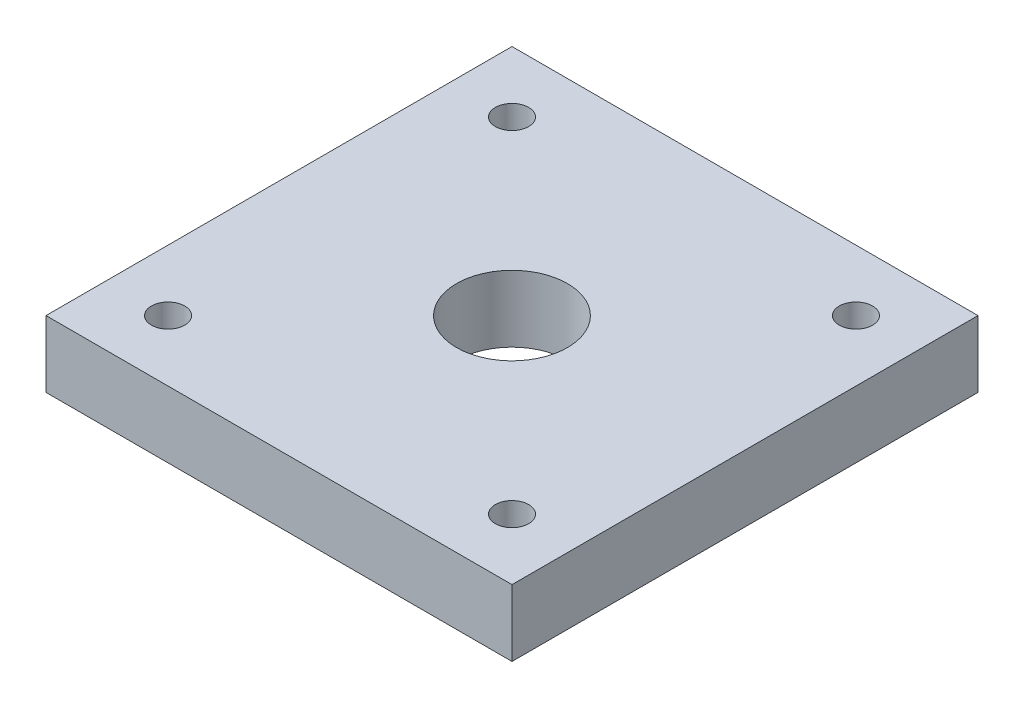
ISO-10303-21;
HEADER;
FILE_DESCRIPTION(('STEP AP214'),'2;1');
FILE_NAME('part.step','',(''),(''),'','','');
FILE_SCHEMA(('AUTOMOTIVE_DESIGN { 1 0 10303 214 1 1 1 1 }'));
ENDSEC;
DATA;
#1=APPLICATION_CONTEXT('core data for automotive mechanical design processes');
#2=APPLICATION_PROTOCOL_DEFINITION('international standard','automotive_design',2000,#1);
#3=PRODUCT_CONTEXT('',#1,'mechanical');
#4=PRODUCT('Part','Part','',(#3));
#5=PRODUCT_RELATED_PRODUCT_CATEGORY('part','',(#4));
#6=PRODUCT_DEFINITION_FORMATION('','',#4);
#7=PRODUCT_DEFINITION_CONTEXT('part definition',#1,'design');
#8=PRODUCT_DEFINITION('design','',#6,#7);
#9=PRODUCT_DEFINITION_SHAPE('','',#8);
#10=(LENGTH_UNIT() NAMED_UNIT(*) SI_UNIT(.MILLI.,.METRE.));
#11=(NAMED_UNIT(*) PLANE_ANGLE_UNIT() SI_UNIT($,.RADIAN.));
#12=(NAMED_UNIT(*) SI_UNIT($,.STERADIAN.) SOLID_ANGLE_UNIT());
#13=UNCERTAINTY_MEASURE_WITH_UNIT(LENGTH_MEASURE(1.E-05),#10,'distance_accuracy_value','');
#14=(GEOMETRIC_REPRESENTATION_CONTEXT(3) GLOBAL_UNCERTAINTY_ASSIGNED_CONTEXT((#13)) GLOBAL_UNIT_ASSIGNED_CONTEXT((#10,
#11,#12)) REPRESENTATION_CONTEXT('',''));
#15=CARTESIAN_POINT('',(0.,0.,0.));
#16=DIRECTION('',(0.,0.,1.));
#17=DIRECTION('',(1.,0.,0.));
#18=AXIS2_PLACEMENT_3D('',#15,#16,#17);
#19=CARTESIAN_POINT('',(0.,6.,0.));
#20=DIRECTION('',(0.,-1.,0.));
#21=DIRECTION('',(0.,0.,-1.));
#22=AXIS2_PLACEMENT_3D('',#19,#20,#21);
#23=PLANE('',#22);
#24=CARTESIAN_POINT('',(5.5,6.,-5.50000000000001));
#25=DIRECTION('',(0.,1.,0.));
#26=DIRECTION('',(0.,0.,1.));
#27=AXIS2_PLACEMENT_3D('',#24,#25,#26);
#28=CIRCLE('',#27,1.5);
#29=CARTESIAN_POINT('',(5.5,6.,-4.));
#30=VERTEX_POINT('',#29);
#31=EDGE_CURVE('E129',#30,#30,#28,.T.);
#32=ORIENTED_EDGE('',*,*,#31,.F.);
#33=EDGE_LOOP('',(#32));
#34=FACE_BOUND('',#33,.T.);
#35=CARTESIAN_POINT('',(36.5,6.,-36.5));
#36=DIRECTION('',(0.,1.,0.));
#37=DIRECTION('',(0.,0.,1.));
#38=AXIS2_PLACEMENT_3D('',#35,#36,#37);
#39=CIRCLE('',#38,1.5);
#40=CARTESIAN_POINT('',(36.5,6.,-35.));
#41=VERTEX_POINT('',#40);
#42=EDGE_CURVE('E117',#41,#41,#39,.T.);
#43=ORIENTED_EDGE('',*,*,#42,.F.);
#44=EDGE_LOOP('',(#43));
#45=FACE_BOUND('',#44,.T.);
#46=DIRECTION('',(0.,0.,1.));
#47=VECTOR('',#46,1.);
#48=CARTESIAN_POINT('',(0.,6.,0.));
#49=LINE('',#48,#47);
#50=CARTESIAN_POINT('',(0.,6.,-42.));
#51=VERTEX_POINT('',#50);
#52=CARTESIAN_POINT('',(0.,6.,0.));
#53=VERTEX_POINT('',#52);
#54=EDGE_CURVE('E87',#51,#53,#49,.T.);
#55=ORIENTED_EDGE('',*,*,#54,.T.);
#56=DIRECTION('',(1.,0.,0.));
#57=VECTOR('',#56,1.);
#58=CARTESIAN_POINT('',(0.,6.,0.));
#59=LINE('',#58,#57);
#60=CARTESIAN_POINT('',(42.,6.,0.));
#61=VERTEX_POINT('',#60);
#62=EDGE_CURVE('E82',#53,#61,#59,.T.);
#63=ORIENTED_EDGE('',*,*,#62,.T.);
#64=DIRECTION('',(0.,0.,-1.));
#65=VECTOR('',#64,1.);
#66=CARTESIAN_POINT('',(42.,6.,0.));
#67=LINE('',#66,#65);
#68=CARTESIAN_POINT('',(42.,6.,-42.));
#69=VERTEX_POINT('',#68);
#70=EDGE_CURVE('E85',#61,#69,#67,.T.);
#71=ORIENTED_EDGE('',*,*,#70,.T.);
#72=DIRECTION('',(-1.,0.,0.));
#73=VECTOR('',#72,1.);
#74=CARTESIAN_POINT('',(0.,6.,-42.));
#75=LINE('',#74,#73);
#76=EDGE_CURVE('E52',#69,#51,#75,.T.);
#77=ORIENTED_EDGE('',*,*,#76,.T.);
#78=EDGE_LOOP('',(#55,#63,#71,#77));
#79=FACE_BOUND('',#78,.T.);
#80=CARTESIAN_POINT('',(5.5,6.,-36.5));
#81=DIRECTION('',(0.,1.,0.));
#82=DIRECTION('',(0.,0.,1.));
#83=AXIS2_PLACEMENT_3D('',#80,#81,#82);
#84=CIRCLE('',#83,1.5);
#85=CARTESIAN_POINT('',(5.5,6.,-35.));
#86=VERTEX_POINT('',#85);
#87=EDGE_CURVE('E102',#86,#86,#84,.T.);
#88=ORIENTED_EDGE('',*,*,#87,.F.);
#89=EDGE_LOOP('',(#88));
#90=FACE_BOUND('',#89,.T.);
#91=CARTESIAN_POINT('',(36.5,6.,-5.50000000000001));
#92=DIRECTION('',(0.,1.,0.));
#93=DIRECTION('',(0.,0.,1.));
#94=AXIS2_PLACEMENT_3D('',#91,#92,#93);
#95=CIRCLE('',#94,1.5);
#96=CARTESIAN_POINT('',(36.5,6.,-4.));
#97=VERTEX_POINT('',#96);
#98=EDGE_CURVE('E123',#97,#97,#95,.T.);
#99=ORIENTED_EDGE('',*,*,#98,.F.);
#100=EDGE_LOOP('',(#99));
#101=FACE_BOUND('',#100,.T.);
#102=CARTESIAN_POINT('',(21.,6.,-21.));
#103=DIRECTION('',(0.,1.,0.));
#104=DIRECTION('',(0.,0.,1.));
#105=AXIS2_PLACEMENT_3D('',#102,#103,#104);
#106=CIRCLE('',#105,5.);
#107=CARTESIAN_POINT('',(21.,6.,-16.));
#108=VERTEX_POINT('',#107);
#109=EDGE_CURVE('E135',#108,#108,#106,.T.);
#110=ORIENTED_EDGE('',*,*,#109,.F.);
#111=EDGE_LOOP('',(#110));
#112=FACE_BOUND('',#111,.T.);
#113=ADVANCED_FACE('F35',(#34,#45,#79,#90,#101,#112),#23,.F.);
#114=CARTESIAN_POINT('',(0.,0.,0.));
#115=DIRECTION('',(0.,-1.,0.));
#116=DIRECTION('',(0.,0.,-1.));
#117=AXIS2_PLACEMENT_3D('',#114,#115,#116);
#118=PLANE('',#117);
#119=CARTESIAN_POINT('',(5.5,0.,-5.50000000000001));
#120=DIRECTION('',(0.,1.,0.));
#121=DIRECTION('',(0.,0.,1.));
#122=AXIS2_PLACEMENT_3D('',#119,#120,#121);
#123=CIRCLE('',#122,1.5);
#124=CARTESIAN_POINT('',(5.5,0.,-4.));
#125=VERTEX_POINT('',#124);
#126=EDGE_CURVE('E132',#125,#125,#123,.T.);
#127=ORIENTED_EDGE('',*,*,#126,.T.);
#128=EDGE_LOOP('',(#127));
#129=FACE_BOUND('',#128,.T.);
#130=CARTESIAN_POINT('',(36.5,0.,-36.5));
#131=DIRECTION('',(0.,1.,0.));
#132=DIRECTION('',(0.,0.,1.));
#133=AXIS2_PLACEMENT_3D('',#130,#131,#132);
#134=CIRCLE('',#133,1.5);
#135=CARTESIAN_POINT('',(36.5,0.,-35.));
#136=VERTEX_POINT('',#135);
#137=EDGE_CURVE('E120',#136,#136,#134,.T.);
#138=ORIENTED_EDGE('',*,*,#137,.T.);
#139=EDGE_LOOP('',(#138));
#140=FACE_BOUND('',#139,.T.);
#141=DIRECTION('',(0.,0.,1.));
#142=VECTOR('',#141,1.);
#143=CARTESIAN_POINT('',(0.,0.,0.));
#144=LINE('',#143,#142);
#145=CARTESIAN_POINT('',(0.,0.,-42.));
#146=VERTEX_POINT('',#145);
#147=CARTESIAN_POINT('',(0.,0.,0.));
#148=VERTEX_POINT('',#147);
#149=EDGE_CURVE('E99',#146,#148,#144,.T.);
#150=ORIENTED_EDGE('',*,*,#149,.F.);
#151=DIRECTION('',(-1.,0.,0.));
#152=VECTOR('',#151,1.);
#153=CARTESIAN_POINT('',(0.,0.,-42.));
#154=LINE('',#153,#152);
#155=CARTESIAN_POINT('',(42.,0.,-42.));
#156=VERTEX_POINT('',#155);
#157=EDGE_CURVE('E75',#156,#146,#154,.T.);
#158=ORIENTED_EDGE('',*,*,#157,.F.);
#159=DIRECTION('',(0.,0.,-1.));
#160=VECTOR('',#159,1.);
#161=CARTESIAN_POINT('',(42.,0.,0.));
#162=LINE('',#161,#160);
#163=CARTESIAN_POINT('',(42.,0.,0.));
#164=VERTEX_POINT('',#163);
#165=EDGE_CURVE('E69',#164,#156,#162,.T.);
#166=ORIENTED_EDGE('',*,*,#165,.F.);
#167=DIRECTION('',(1.,0.,0.));
#168=VECTOR('',#167,1.);
#169=CARTESIAN_POINT('',(0.,0.,0.));
#170=LINE('',#169,#168);
#171=EDGE_CURVE('E91',#148,#164,#170,.T.);
#172=ORIENTED_EDGE('',*,*,#171,.F.);
#173=EDGE_LOOP('',(#150,#158,#166,#172));
#174=FACE_BOUND('',#173,.T.);
#175=CARTESIAN_POINT('',(5.5,0.,-36.5));
#176=DIRECTION('',(0.,1.,0.));
#177=DIRECTION('',(0.,0.,1.));
#178=AXIS2_PLACEMENT_3D('',#175,#176,#177);
#179=CIRCLE('',#178,1.5);
#180=CARTESIAN_POINT('',(5.5,0.,-35.));
#181=VERTEX_POINT('',#180);
#182=EDGE_CURVE('E114',#181,#181,#179,.T.);
#183=ORIENTED_EDGE('',*,*,#182,.T.);
#184=EDGE_LOOP('',(#183));
#185=FACE_BOUND('',#184,.T.);
#186=CARTESIAN_POINT('',(36.5,0.,-5.50000000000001));
#187=DIRECTION('',(0.,1.,0.));
#188=DIRECTION('',(0.,0.,1.));
#189=AXIS2_PLACEMENT_3D('',#186,#187,#188);
#190=CIRCLE('',#189,1.5);
#191=CARTESIAN_POINT('',(36.5,0.,-4.));
#192=VERTEX_POINT('',#191);
#193=EDGE_CURVE('E126',#192,#192,#190,.T.);
#194=ORIENTED_EDGE('',*,*,#193,.T.);
#195=EDGE_LOOP('',(#194));
#196=FACE_BOUND('',#195,.T.);
#197=CARTESIAN_POINT('',(21.,0.,-21.));
#198=DIRECTION('',(0.,1.,0.));
#199=DIRECTION('',(0.,0.,1.));
#200=AXIS2_PLACEMENT_3D('',#197,#198,#199);
#201=CIRCLE('',#200,5.);
#202=CARTESIAN_POINT('',(21.,0.,-16.));
#203=VERTEX_POINT('',#202);
#204=EDGE_CURVE('E138',#203,#203,#201,.T.);
#205=ORIENTED_EDGE('',*,*,#204,.T.);
#206=EDGE_LOOP('',(#205));
#207=FACE_BOUND('',#206,.T.);
#208=ADVANCED_FACE('F110',(#129,#140,#174,#185,#196,#207),#118,.T.);
#209=CARTESIAN_POINT('',(0.,6.,0.));
#210=DIRECTION('',(1.,0.,0.));
#211=DIRECTION('',(0.,0.,-1.));
#212=AXIS2_PLACEMENT_3D('',#209,#210,#211);
#213=PLANE('',#212);
#214=ORIENTED_EDGE('',*,*,#149,.T.);
#215=DIRECTION('',(0.,-1.,0.));
#216=VECTOR('',#215,1.);
#217=CARTESIAN_POINT('',(0.,6.,0.));
#218=LINE('',#217,#216);
#219=EDGE_CURVE('E11',#53,#148,#218,.T.);
#220=ORIENTED_EDGE('',*,*,#219,.F.);
#221=ORIENTED_EDGE('',*,*,#54,.F.);
#222=DIRECTION('',(0.,-1.,0.));
#223=VECTOR('',#222,1.);
#224=CARTESIAN_POINT('',(0.,6.,-42.));
#225=LINE('',#224,#223);
#226=EDGE_CURVE('E95',#51,#146,#225,.T.);
#227=ORIENTED_EDGE('',*,*,#226,.T.);
#228=EDGE_LOOP('',(#214,#220,#221,#227));
#229=FACE_BOUND('',#228,.T.);
#230=ADVANCED_FACE('F37',(#229),#213,.F.);
#231=CARTESIAN_POINT('',(0.,6.,0.));
#232=DIRECTION('',(0.,0.,-1.));
#233=DIRECTION('',(-1.,0.,0.));
#234=AXIS2_PLACEMENT_3D('',#231,#232,#233);
#235=PLANE('',#234);
#236=ORIENTED_EDGE('',*,*,#171,.T.);
#237=DIRECTION('',(0.,-1.,0.));
#238=VECTOR('',#237,1.);
#239=CARTESIAN_POINT('',(42.,6.,0.));
#240=LINE('',#239,#238);
#241=EDGE_CURVE('E44',#61,#164,#240,.T.);
#242=ORIENTED_EDGE('',*,*,#241,.F.);
#243=ORIENTED_EDGE('',*,*,#62,.F.);
#244=ORIENTED_EDGE('',*,*,#219,.T.);
#245=EDGE_LOOP('',(#236,#242,#243,#244));
#246=FACE_BOUND('',#245,.T.);
#247=ADVANCED_FACE('F90',(#246),#235,.F.);
#248=CARTESIAN_POINT('',(42.,6.,0.));
#249=DIRECTION('',(-1.,0.,0.));
#250=DIRECTION('',(0.,0.,1.));
#251=AXIS2_PLACEMENT_3D('',#248,#249,#250);
#252=PLANE('',#251);
#253=ORIENTED_EDGE('',*,*,#165,.T.);
#254=DIRECTION('',(0.,-1.,0.));
#255=VECTOR('',#254,1.);
#256=CARTESIAN_POINT('',(42.,6.,-42.));
#257=LINE('',#256,#255);
#258=EDGE_CURVE('E92',#69,#156,#257,.T.);
#259=ORIENTED_EDGE('',*,*,#258,.F.);
#260=ORIENTED_EDGE('',*,*,#70,.F.);
#261=ORIENTED_EDGE('',*,*,#241,.T.);
#262=EDGE_LOOP('',(#253,#259,#260,#261));
#263=FACE_BOUND('',#262,.T.);
#264=ADVANCED_FACE('F93',(#263),#252,.F.);
#265=CARTESIAN_POINT('',(0.,6.,-42.));
#266=DIRECTION('',(0.,0.,1.));
#267=DIRECTION('',(1.,0.,0.));
#268=AXIS2_PLACEMENT_3D('',#265,#266,#267);
#269=PLANE('',#268);
#270=ORIENTED_EDGE('',*,*,#157,.T.);
#271=ORIENTED_EDGE('',*,*,#226,.F.);
#272=ORIENTED_EDGE('',*,*,#76,.F.);
#273=ORIENTED_EDGE('',*,*,#258,.T.);
#274=EDGE_LOOP('',(#270,#271,#272,#273));
#275=FACE_BOUND('',#274,.T.);
#276=ADVANCED_FACE('F107',(#275),#269,.F.);
#277=CARTESIAN_POINT('',(5.5,6.,-36.5));
#278=DIRECTION('',(0.,-1.,0.));
#279=DIRECTION('',(0.,0.,-1.));
#280=AXIS2_PLACEMENT_3D('',#277,#278,#279);
#281=CYLINDRICAL_SURFACE('',#280,1.5);
#282=ORIENTED_EDGE('',*,*,#87,.T.);
#283=EDGE_LOOP('',(#282));
#284=FACE_BOUND('',#283,.T.);
#285=ORIENTED_EDGE('',*,*,#182,.F.);
#286=EDGE_LOOP('',(#285));
#287=FACE_BOUND('',#286,.T.);
#288=ADVANCED_FACE('F158',(#284,#287),#281,.F.);
#289=CARTESIAN_POINT('',(36.5,6.,-36.5));
#290=DIRECTION('',(0.,-1.,0.));
#291=DIRECTION('',(0.,0.,-1.));
#292=AXIS2_PLACEMENT_3D('',#289,#290,#291);
#293=CYLINDRICAL_SURFACE('',#292,1.5);
#294=ORIENTED_EDGE('',*,*,#42,.T.);
#295=EDGE_LOOP('',(#294));
#296=FACE_BOUND('',#295,.T.);
#297=ORIENTED_EDGE('',*,*,#137,.F.);
#298=EDGE_LOOP('',(#297));
#299=FACE_BOUND('',#298,.T.);
#300=ADVANCED_FACE('F204',(#296,#299),#293,.F.);
#301=CARTESIAN_POINT('',(36.5,6.,-5.50000000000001));
#302=DIRECTION('',(0.,-1.,0.));
#303=DIRECTION('',(0.,0.,-1.));
#304=AXIS2_PLACEMENT_3D('',#301,#302,#303);
#305=CYLINDRICAL_SURFACE('',#304,1.5);
#306=ORIENTED_EDGE('',*,*,#98,.T.);
#307=EDGE_LOOP('',(#306));
#308=FACE_BOUND('',#307,.T.);
#309=ORIENTED_EDGE('',*,*,#193,.F.);
#310=EDGE_LOOP('',(#309));
#311=FACE_BOUND('',#310,.T.);
#312=ADVANCED_FACE('F212',(#308,#311),#305,.F.);
#313=CARTESIAN_POINT('',(5.5,6.,-5.50000000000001));
#314=DIRECTION('',(0.,-1.,0.));
#315=DIRECTION('',(0.,0.,-1.));
#316=AXIS2_PLACEMENT_3D('',#313,#314,#315);
#317=CYLINDRICAL_SURFACE('',#316,1.5);
#318=ORIENTED_EDGE('',*,*,#31,.T.);
#319=EDGE_LOOP('',(#318));
#320=FACE_BOUND('',#319,.T.);
#321=ORIENTED_EDGE('',*,*,#126,.F.);
#322=EDGE_LOOP('',(#321));
#323=FACE_BOUND('',#322,.T.);
#324=ADVANCED_FACE('F220',(#320,#323),#317,.F.);
#325=CARTESIAN_POINT('',(21.,6.,-21.));
#326=DIRECTION('',(0.,-1.,0.));
#327=DIRECTION('',(0.,0.,-1.));
#328=AXIS2_PLACEMENT_3D('',#325,#326,#327);
#329=CYLINDRICAL_SURFACE('',#328,5.);
#330=ORIENTED_EDGE('',*,*,#109,.T.);
#331=EDGE_LOOP('',(#330));
#332=FACE_BOUND('',#331,.T.);
#333=ORIENTED_EDGE('',*,*,#204,.F.);
#334=EDGE_LOOP('',(#333));
#335=FACE_BOUND('',#334,.T.);
#336=ADVANCED_FACE('F144',(#332,#335),#329,.F.);
#337=CLOSED_SHELL('',(#113,#208,#230,#247,#264,#276,#288,#300,#312,#324,#336));
#338=MANIFOLD_SOLID_BREP('B2',#337);
#339=ADVANCED_BREP_SHAPE_REPRESENTATION('',(#18,#338),#14);
#340=SHAPE_DEFINITION_REPRESENTATION(#9,#339);
ENDSEC;
END-ISO-10303-21;
